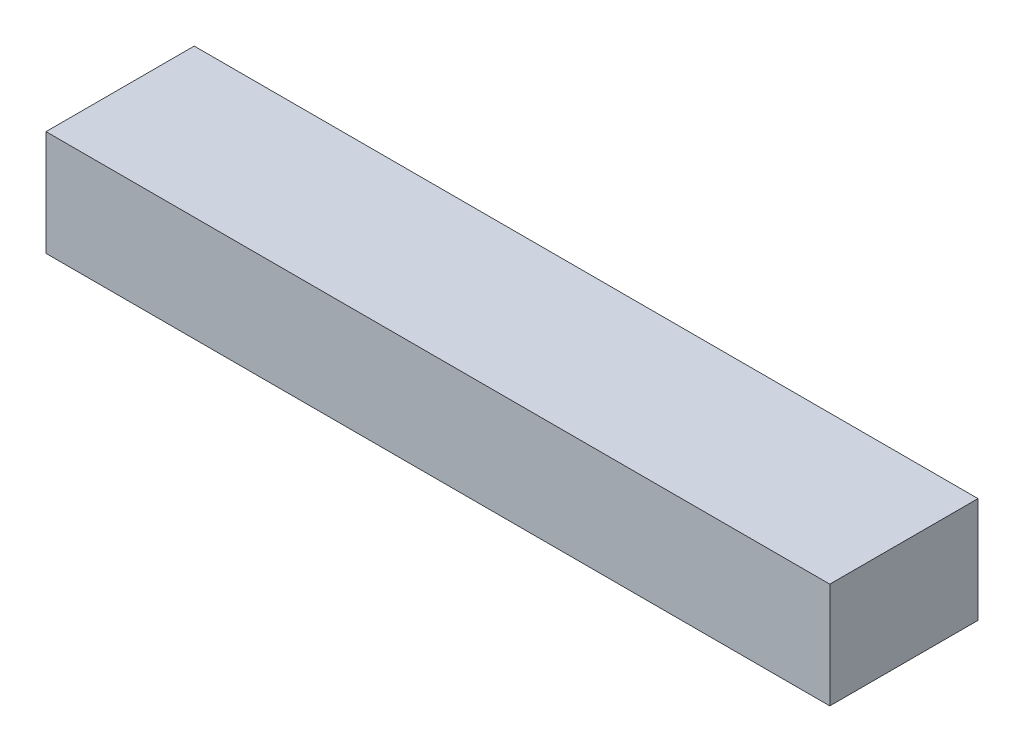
from build123d import *

# Parameters (mm, degrees)
ESQUISSE1_W        = 370.214533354
ESQUISSE1_H        = 49.823076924
BOSS_EXTRU_1_DEPTH = 35


with BuildPart() as part:
    # Esquisse1 → Boss.-Extru.1 (new, symmetric)
    with BuildSketch(Plane.XY):
        Rectangle(ESQUISSE1_W, ESQUISSE1_H)
    extrude(amount=BOSS_EXTRU_1_DEPTH, both=True)


solid = part.part
